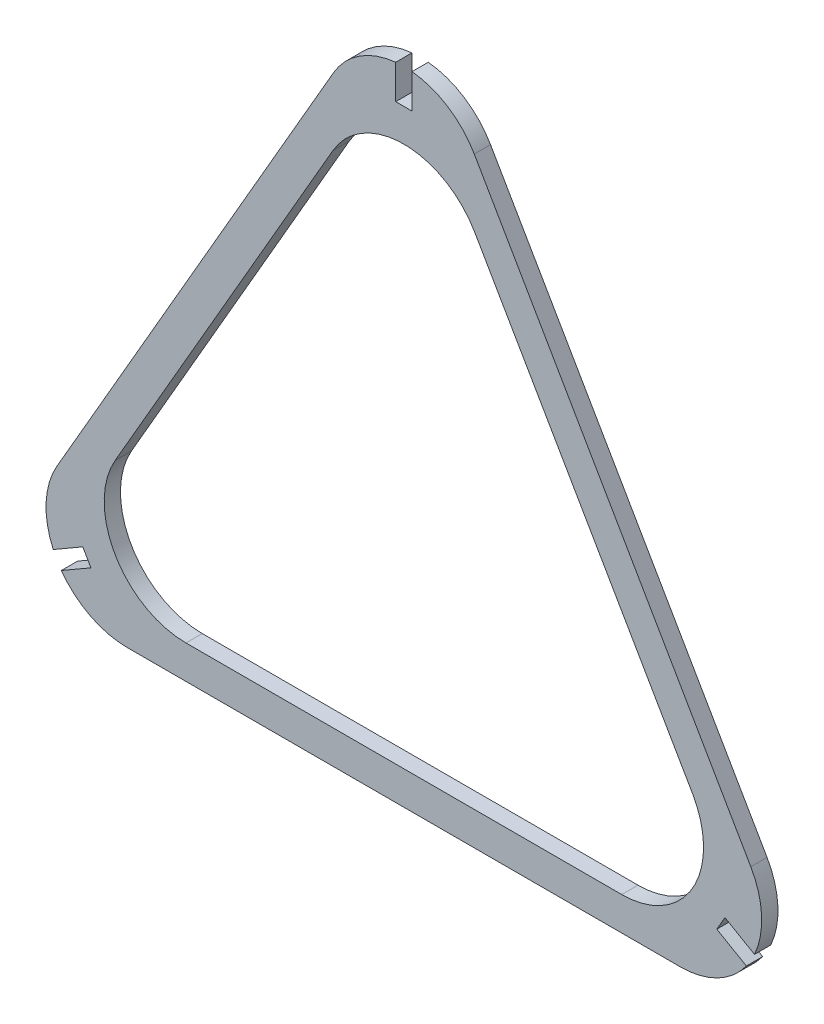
ISO-10303-21;
HEADER;
FILE_DESCRIPTION(('STEP AP214'),'2;1');
FILE_NAME('part.step','',(''),(''),'','','');
FILE_SCHEMA(('AUTOMOTIVE_DESIGN { 1 0 10303 214 1 1 1 1 }'));
ENDSEC;
DATA;
#1=APPLICATION_CONTEXT('core data for automotive mechanical design processes');
#2=APPLICATION_PROTOCOL_DEFINITION('international standard','automotive_design',2000,#1);
#3=PRODUCT_CONTEXT('',#1,'mechanical');
#4=PRODUCT('Part','Part','',(#3));
#5=PRODUCT_RELATED_PRODUCT_CATEGORY('part','',(#4));
#6=PRODUCT_DEFINITION_FORMATION('','',#4);
#7=PRODUCT_DEFINITION_CONTEXT('part definition',#1,'design');
#8=PRODUCT_DEFINITION('design','',#6,#7);
#9=PRODUCT_DEFINITION_SHAPE('','',#8);
#10=(LENGTH_UNIT() NAMED_UNIT(*) SI_UNIT(.MILLI.,.METRE.));
#11=(NAMED_UNIT(*) PLANE_ANGLE_UNIT() SI_UNIT($,.RADIAN.));
#12=(NAMED_UNIT(*) SI_UNIT($,.STERADIAN.) SOLID_ANGLE_UNIT());
#13=UNCERTAINTY_MEASURE_WITH_UNIT(LENGTH_MEASURE(1.E-05),#10,'distance_accuracy_value','');
#14=(GEOMETRIC_REPRESENTATION_CONTEXT(3) GLOBAL_UNCERTAINTY_ASSIGNED_CONTEXT((#13)) GLOBAL_UNIT_ASSIGNED_CONTEXT((#10,
#11,#12)) REPRESENTATION_CONTEXT('',''));
#15=CARTESIAN_POINT('',(0.,0.,0.));
#16=DIRECTION('',(0.,0.,1.));
#17=DIRECTION('',(1.,0.,0.));
#18=AXIS2_PLACEMENT_3D('',#15,#16,#17);
#19=CARTESIAN_POINT('',(0.,0.,4.));
#20=DIRECTION('',(0.,0.,1.));
#21=DIRECTION('',(1.,0.,0.));
#22=AXIS2_PLACEMENT_3D('',#19,#20,#21);
#23=PLANE('',#22);
#24=DIRECTION('',(-0.5,0.866025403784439,0.));
#25=VECTOR('',#24,1.);
#26=CARTESIAN_POINT('',(71.0334802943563,-20.8861989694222,4.));
#27=LINE('',#26,#25);
#28=CARTESIAN_POINT('',(71.0334802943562,-20.8861989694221,4.));
#29=VERTEX_POINT('',#28);
#30=CARTESIAN_POINT('',(17.4287612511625,71.9598979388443,4.));
#31=VERTEX_POINT('',#30);
#32=EDGE_CURVE('E343',#29,#31,#27,.T.);
#33=ORIENTED_EDGE('',*,*,#32,.F.);
#34=CARTESIAN_POINT('',(53.6047190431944,-30.9486989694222,4.));
#35=DIRECTION('',(0.,0.,1.));
#36=DIRECTION('',(1.,0.,0.));
#37=AXIS2_PLACEMENT_3D('',#34,#35,#36);
#38=CIRCLE('',#37,20.125);
#39=CARTESIAN_POINT('',(53.6047190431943,-51.0736989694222,4.));
#40=VERTEX_POINT('',#39);
#41=EDGE_CURVE('E312',#29,#40,#38,.F.);
#42=ORIENTED_EDGE('',*,*,#41,.T.);
#43=DIRECTION('',(1.,0.,0.));
#44=VECTOR('',#43,1.);
#45=CARTESIAN_POINT('',(53.6047190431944,-51.0736989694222,4.));
#46=LINE('',#45,#44);
#47=CARTESIAN_POINT('',(-53.6047190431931,-51.0736989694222,4.));
#48=VERTEX_POINT('',#47);
#49=EDGE_CURVE('E331',#48,#40,#46,.T.);
#50=ORIENTED_EDGE('',*,*,#49,.F.);
#51=CARTESIAN_POINT('',(-53.6047190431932,-30.9486989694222,4.));
#52=DIRECTION('',(0.,0.,1.));
#53=DIRECTION('',(1.,0.,0.));
#54=AXIS2_PLACEMENT_3D('',#51,#52,#53);
#55=CIRCLE('',#54,20.125);
#56=CARTESIAN_POINT('',(-71.033480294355,-20.8861989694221,4.));
#57=VERTEX_POINT('',#56);
#58=EDGE_CURVE('E334',#57,#48,#55,.T.);
#59=ORIENTED_EDGE('',*,*,#58,.F.);
#60=DIRECTION('',(-0.5,-0.866025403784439,0.));
#61=VECTOR('',#60,1.);
#62=CARTESIAN_POINT('',(-44.2311207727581,25.5368494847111,4.));
#63=LINE('',#62,#61);
#64=CARTESIAN_POINT('',(-17.4287612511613,71.9598979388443,4.));
#65=VERTEX_POINT('',#64);
#66=EDGE_CURVE('E337',#65,#57,#63,.T.);
#67=ORIENTED_EDGE('',*,*,#66,.F.);
#68=CARTESIAN_POINT('',(6.24500451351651E-13,61.8973979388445,4.));
#69=DIRECTION('',(0.,0.,1.));
#70=DIRECTION('',(1.,0.,0.));
#71=AXIS2_PLACEMENT_3D('',#68,#69,#70);
#72=CIRCLE('',#71,20.125);
#73=EDGE_CURVE('E340',#31,#65,#72,.T.);
#74=ORIENTED_EDGE('',*,*,#73,.F.);
#75=EDGE_LOOP('',(#33,#42,#50,#59,#67,#74));
#76=FACE_BOUND('',#75,.T.);
#77=CARTESIAN_POINT('',(68.0384757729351,-39.2820323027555,4.));
#78=DIRECTION('',(0.,0.,1.));
#79=DIRECTION('',(1.,0.,0.));
#80=AXIS2_PLACEMENT_3D('',#77,#78,#79);
#81=CIRCLE('',#80,20.);
#82=CARTESIAN_POINT('',(68.0384757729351,-59.2820323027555,4.));
#83=VERTEX_POINT('',#82);
#84=CARTESIAN_POINT('',(84.2721637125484,-50.9639574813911,4.));
#85=VERTEX_POINT('',#84);
#86=EDGE_CURVE('E218',#83,#85,#81,.T.);
#87=ORIENTED_EDGE('',*,*,#86,.T.);
#88=DIRECTION('',(-0.866025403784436,0.500000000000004,0.));
#89=VECTOR('',#88,1.);
#90=CARTESIAN_POINT('',(77.1039637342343,-46.8253952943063,4.));
#91=LINE('',#90,#89);
#92=CARTESIAN_POINT('',(76.9957105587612,-46.7628952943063,4.));
#93=VERTEX_POINT('',#92);
#94=EDGE_CURVE('E448',#85,#93,#91,.T.);
#95=ORIENTED_EDGE('',*,*,#94,.T.);
#96=DIRECTION('',(-0.500000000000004,-0.866025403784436,0.));
#97=VECTOR('',#96,1.);
#98=CARTESIAN_POINT('',(78.9332105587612,-43.4070468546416,4.));
#99=LINE('',#98,#97);
#100=CARTESIAN_POINT('',(78.9957105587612,-43.2987936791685,4.));
#101=VERTEX_POINT('',#100);
#102=EDGE_CURVE('E211',#93,#101,#99,.F.);
#103=ORIENTED_EDGE('',*,*,#102,.T.);
#104=DIRECTION('',(0.866025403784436,-0.500000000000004,0.));
#105=VECTOR('',#104,1.);
#106=CARTESIAN_POINT('',(79.1039637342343,-43.3612936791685,4.));
#107=LINE('',#106,#105);
#108=CARTESIAN_POINT('',(86.2721637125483,-47.4998558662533,4.));
#109=VERTEX_POINT('',#108);
#110=EDGE_CURVE('E198',#101,#109,#107,.T.);
#111=ORIENTED_EDGE('',*,*,#110,.T.);
#112=CARTESIAN_POINT('',(85.3589838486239,-29.2820323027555,4.));
#113=VERTEX_POINT('',#112);
#114=EDGE_CURVE('E208',#109,#113,#81,.T.);
#115=ORIENTED_EDGE('',*,*,#114,.T.);
#116=DIRECTION('',(-0.5,0.866025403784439,0.));
#117=VECTOR('',#116,1.);
#118=CARTESIAN_POINT('',(102.679491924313,-59.2820323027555,4.));
#119=LINE('',#118,#117);
#120=CARTESIAN_POINT('',(17.3205080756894,88.5640646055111,4.));
#121=VERTEX_POINT('',#120);
#122=EDGE_CURVE('E221',#113,#121,#119,.T.);
#123=ORIENTED_EDGE('',*,*,#122,.T.);
#124=CARTESIAN_POINT('',(6.27969898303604E-13,78.5640646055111,4.));
#125=DIRECTION('',(0.,0.,1.));
#126=DIRECTION('',(1.,0.,0.));
#127=AXIS2_PLACEMENT_3D('',#124,#125,#126);
#128=CIRCLE('',#127,20.);
#129=CARTESIAN_POINT('',(2.,98.4638133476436,4.));
#130=VERTEX_POINT('',#129);
#131=EDGE_CURVE('E40',#121,#130,#128,.T.);
#132=ORIENTED_EDGE('',*,*,#131,.T.);
#133=DIRECTION('',(0.,-1.,0.));
#134=VECTOR('',#133,1.);
#135=CARTESIAN_POINT('',(2.,90.1866889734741,4.));
#136=LINE('',#135,#134);
#137=CARTESIAN_POINT('',(2.,90.0616889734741,4.));
#138=VERTEX_POINT('',#137);
#139=EDGE_CURVE('E246',#130,#138,#136,.T.);
#140=ORIENTED_EDGE('',*,*,#139,.T.);
#141=DIRECTION('',(1.,0.,0.));
#142=VECTOR('',#141,1.);
#143=CARTESIAN_POINT('',(-1.875,90.0616889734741,4.));
#144=LINE('',#143,#142);
#145=CARTESIAN_POINT('',(-2.,90.0616889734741,4.));
#146=VERTEX_POINT('',#145);
#147=EDGE_CURVE('E249',#138,#146,#144,.F.);
#148=ORIENTED_EDGE('',*,*,#147,.T.);
#149=DIRECTION('',(0.,1.,0.));
#150=VECTOR('',#149,1.);
#151=CARTESIAN_POINT('',(-2.,90.1866889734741,4.));
#152=LINE('',#151,#150);
#153=CARTESIAN_POINT('',(-2.,98.4638133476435,4.));
#154=VERTEX_POINT('',#153);
#155=EDGE_CURVE('E252',#146,#154,#152,.T.);
#156=ORIENTED_EDGE('',*,*,#155,.T.);
#157=CARTESIAN_POINT('',(-17.3205080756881,88.5640646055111,4.));
#158=VERTEX_POINT('',#157);
#159=EDGE_CURVE('E254',#154,#158,#128,.T.);
#160=ORIENTED_EDGE('',*,*,#159,.T.);
#161=DIRECTION('',(-0.5,-0.866025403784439,0.));
#162=VECTOR('',#161,1.);
#163=CARTESIAN_POINT('',(6.24500451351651E-13,118.564064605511,4.));
#164=LINE('',#163,#162);
#165=CARTESIAN_POINT('',(-85.3589838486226,-29.2820323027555,4.));
#166=VERTEX_POINT('',#165);
#167=EDGE_CURVE('E292',#158,#166,#164,.T.);
#168=ORIENTED_EDGE('',*,*,#167,.T.);
#169=CARTESIAN_POINT('',(-68.0384757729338,-39.2820323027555,4.));
#170=DIRECTION('',(0.,0.,1.));
#171=DIRECTION('',(1.,0.,0.));
#172=AXIS2_PLACEMENT_3D('',#169,#170,#171);
#173=CIRCLE('',#172,20.);
#174=CARTESIAN_POINT('',(-86.2721637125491,-47.4998558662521,4.));
#175=VERTEX_POINT('',#174);
#176=EDGE_CURVE('E223',#166,#175,#173,.T.);
#177=ORIENTED_EDGE('',*,*,#176,.T.);
#178=DIRECTION('',(0.866025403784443,0.499999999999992,0.));
#179=VECTOR('',#178,1.);
#180=CARTESIAN_POINT('',(-79.1039637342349,-43.3612936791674,4.));
#181=LINE('',#180,#179);
#182=CARTESIAN_POINT('',(-78.9957105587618,-43.2987936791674,4.));
#183=VERTEX_POINT('',#182);
#184=EDGE_CURVE('E479',#175,#183,#181,.T.);
#185=ORIENTED_EDGE('',*,*,#184,.T.);
#186=DIRECTION('',(-0.499999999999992,0.866025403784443,0.));
#187=VECTOR('',#186,1.);
#188=CARTESIAN_POINT('',(-77.0582105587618,-46.6546421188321,4.));
#189=LINE('',#188,#187);
#190=CARTESIAN_POINT('',(-76.9957105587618,-46.7628952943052,4.));
#191=VERTEX_POINT('',#190);
#192=EDGE_CURVE('E470',#183,#191,#189,.F.);
#193=ORIENTED_EDGE('',*,*,#192,.T.);
#194=DIRECTION('',(-0.866025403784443,-0.499999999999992,0.));
#195=VECTOR('',#194,1.);
#196=CARTESIAN_POINT('',(-77.1039637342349,-46.8253952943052,4.));
#197=LINE('',#196,#195);
#198=CARTESIAN_POINT('',(-84.272163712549,-50.9639574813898,4.));
#199=VERTEX_POINT('',#198);
#200=EDGE_CURVE('E461',#191,#199,#197,.T.);
#201=ORIENTED_EDGE('',*,*,#200,.T.);
#202=CARTESIAN_POINT('',(-68.0384757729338,-59.2820323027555,4.));
#203=VERTEX_POINT('',#202);
#204=EDGE_CURVE('E231',#199,#203,#173,.T.);
#205=ORIENTED_EDGE('',*,*,#204,.T.);
#206=DIRECTION('',(1.,0.,0.));
#207=VECTOR('',#206,1.);
#208=CARTESIAN_POINT('',(-102.679491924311,-59.2820323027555,4.));
#209=LINE('',#208,#207);
#210=EDGE_CURVE('E219',#203,#83,#209,.T.);
#211=ORIENTED_EDGE('',*,*,#210,.T.);
#212=EDGE_LOOP('',(#87,#95,#103,#111,#115,#123,#132,#140,#148,#156,#160,#168,#177,#185,#193,
#201,#205,#211));
#213=FACE_BOUND('',#212,.T.);
#214=ADVANCED_FACE('F37',(#76,#213),#23,.T.);
#215=CARTESIAN_POINT('',(0.,0.,0.));
#216=DIRECTION('',(0.,0.,1.));
#217=DIRECTION('',(1.,0.,0.));
#218=AXIS2_PLACEMENT_3D('',#215,#216,#217);
#219=PLANE('',#218);
#220=CARTESIAN_POINT('',(53.6047190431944,-30.9486989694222,0.));
#221=DIRECTION('',(0.,0.,-1.));
#222=DIRECTION('',(-1.,0.,0.));
#223=AXIS2_PLACEMENT_3D('',#220,#221,#222);
#224=CIRCLE('',#223,20.125);
#225=CARTESIAN_POINT('',(71.0334802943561,-20.886198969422,0.));
#226=VERTEX_POINT('',#225);
#227=CARTESIAN_POINT('',(53.6047190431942,-51.0736989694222,0.));
#228=VERTEX_POINT('',#227);
#229=EDGE_CURVE('E234',#226,#228,#224,.T.);
#230=ORIENTED_EDGE('',*,*,#229,.F.);
#231=DIRECTION('',(-0.5,0.866025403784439,0.));
#232=VECTOR('',#231,1.);
#233=CARTESIAN_POINT('',(71.0334802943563,-20.8861989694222,0.));
#234=LINE('',#233,#232);
#235=CARTESIAN_POINT('',(17.4287612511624,71.9598979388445,0.));
#236=VERTEX_POINT('',#235);
#237=EDGE_CURVE('E291',#226,#236,#234,.T.);
#238=ORIENTED_EDGE('',*,*,#237,.T.);
#239=CARTESIAN_POINT('',(6.24500451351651E-13,61.8973979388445,0.));
#240=DIRECTION('',(0.,0.,-1.));
#241=DIRECTION('',(-1.,0.,0.));
#242=AXIS2_PLACEMENT_3D('',#239,#240,#241);
#243=CIRCLE('',#242,20.125);
#244=CARTESIAN_POINT('',(-17.4287612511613,71.9598979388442,0.));
#245=VERTEX_POINT('',#244);
#246=EDGE_CURVE('E359',#236,#245,#243,.F.);
#247=ORIENTED_EDGE('',*,*,#246,.T.);
#248=DIRECTION('',(-0.5,-0.866025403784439,0.));
#249=VECTOR('',#248,1.);
#250=CARTESIAN_POINT('',(-44.2311207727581,25.5368494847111,0.));
#251=LINE('',#250,#249);
#252=CARTESIAN_POINT('',(-71.0334802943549,-20.886198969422,0.));
#253=VERTEX_POINT('',#252);
#254=EDGE_CURVE('E284',#245,#253,#251,.T.);
#255=ORIENTED_EDGE('',*,*,#254,.T.);
#256=CARTESIAN_POINT('',(-53.6047190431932,-30.9486989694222,0.));
#257=DIRECTION('',(0.,0.,-1.));
#258=DIRECTION('',(-1.,0.,0.));
#259=AXIS2_PLACEMENT_3D('',#256,#257,#258);
#260=CIRCLE('',#259,20.125);
#261=CARTESIAN_POINT('',(-53.6047190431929,-51.0736989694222,0.));
#262=VERTEX_POINT('',#261);
#263=EDGE_CURVE('E278',#253,#262,#260,.F.);
#264=ORIENTED_EDGE('',*,*,#263,.T.);
#265=DIRECTION('',(1.,0.,0.));
#266=VECTOR('',#265,1.);
#267=CARTESIAN_POINT('',(53.6047190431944,-51.0736989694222,0.));
#268=LINE('',#267,#266);
#269=EDGE_CURVE('E270',#262,#228,#268,.T.);
#270=ORIENTED_EDGE('',*,*,#269,.T.);
#271=EDGE_LOOP('',(#230,#238,#247,#255,#264,#270));
#272=FACE_BOUND('',#271,.T.);
#273=DIRECTION('',(-0.866025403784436,0.500000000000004,0.));
#274=VECTOR('',#273,1.);
#275=CARTESIAN_POINT('',(-1.00000000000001,-1.73205080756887,0.));
#276=LINE('',#275,#274);
#277=CARTESIAN_POINT('',(84.2721637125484,-50.9639574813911,0.));
#278=VERTEX_POINT('',#277);
#279=CARTESIAN_POINT('',(76.9957105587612,-46.7628952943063,0.));
#280=VERTEX_POINT('',#279);
#281=EDGE_CURVE('E451',#278,#280,#276,.T.);
#282=ORIENTED_EDGE('',*,*,#281,.F.);
#283=CARTESIAN_POINT('',(68.0384757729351,-39.2820323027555,0.));
#284=DIRECTION('',(0.,0.,1.));
#285=DIRECTION('',(1.,0.,0.));
#286=AXIS2_PLACEMENT_3D('',#283,#284,#285);
#287=CIRCLE('',#286,20.);
#288=CARTESIAN_POINT('',(68.0384757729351,-59.2820323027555,0.));
#289=VERTEX_POINT('',#288);
#290=EDGE_CURVE('E269',#278,#289,#287,.F.);
#291=ORIENTED_EDGE('',*,*,#290,.T.);
#292=DIRECTION('',(1.,0.,0.));
#293=VECTOR('',#292,1.);
#294=CARTESIAN_POINT('',(-102.679491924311,-59.2820323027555,0.));
#295=LINE('',#294,#293);
#296=CARTESIAN_POINT('',(-68.0384757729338,-59.2820323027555,0.));
#297=VERTEX_POINT('',#296);
#298=EDGE_CURVE('E235',#297,#289,#295,.T.);
#299=ORIENTED_EDGE('',*,*,#298,.F.);
#300=CARTESIAN_POINT('',(-68.0384757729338,-39.2820323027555,0.));
#301=DIRECTION('',(0.,0.,1.));
#302=DIRECTION('',(1.,0.,0.));
#303=AXIS2_PLACEMENT_3D('',#300,#301,#302);
#304=CIRCLE('',#303,20.);
#305=CARTESIAN_POINT('',(-84.2721637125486,-50.9639574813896,0.));
#306=VERTEX_POINT('',#305);
#307=EDGE_CURVE('E258',#297,#306,#304,.F.);
#308=ORIENTED_EDGE('',*,*,#307,.T.);
#309=DIRECTION('',(-0.866025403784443,-0.499999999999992,0.));
#310=VECTOR('',#309,1.);
#311=CARTESIAN_POINT('',(0.999999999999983,-1.73205080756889,0.));
#312=LINE('',#311,#310);
#313=CARTESIAN_POINT('',(-76.9957105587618,-46.7628952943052,0.));
#314=VERTEX_POINT('',#313);
#315=EDGE_CURVE('E53',#314,#306,#312,.T.);
#316=ORIENTED_EDGE('',*,*,#315,.F.);
#317=DIRECTION('',(0.499999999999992,-0.866025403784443,0.));
#318=VECTOR('',#317,1.);
#319=CARTESIAN_POINT('',(-77.9957105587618,-45.0308444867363,0.));
#320=LINE('',#319,#318);
#321=CARTESIAN_POINT('',(-78.9957105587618,-43.2987936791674,0.));
#322=VERTEX_POINT('',#321);
#323=EDGE_CURVE('E467',#322,#314,#320,.T.);
#324=ORIENTED_EDGE('',*,*,#323,.F.);
#325=DIRECTION('',(0.866025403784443,0.499999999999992,0.));
#326=VECTOR('',#325,1.);
#327=CARTESIAN_POINT('',(-0.999999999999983,1.73205080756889,0.));
#328=LINE('',#327,#326);
#329=CARTESIAN_POINT('',(-86.2721637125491,-47.4998558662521,0.));
#330=VERTEX_POINT('',#329);
#331=EDGE_CURVE('E476',#330,#322,#328,.T.);
#332=ORIENTED_EDGE('',*,*,#331,.F.);
#333=CARTESIAN_POINT('',(-85.3589838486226,-29.2820323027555,0.));
#334=VERTEX_POINT('',#333);
#335=EDGE_CURVE('E267',#330,#334,#304,.F.);
#336=ORIENTED_EDGE('',*,*,#335,.T.);
#337=DIRECTION('',(-0.5,-0.866025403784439,0.));
#338=VECTOR('',#337,1.);
#339=CARTESIAN_POINT('',(6.24500451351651E-13,118.564064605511,0.));
#340=LINE('',#339,#338);
#341=CARTESIAN_POINT('',(-17.3205080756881,88.5640646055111,0.));
#342=VERTEX_POINT('',#341);
#343=EDGE_CURVE('E297',#342,#334,#340,.T.);
#344=ORIENTED_EDGE('',*,*,#343,.F.);
#345=CARTESIAN_POINT('',(6.27969898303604E-13,78.5640646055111,0.));
#346=DIRECTION('',(0.,0.,1.));
#347=DIRECTION('',(1.,0.,0.));
#348=AXIS2_PLACEMENT_3D('',#345,#346,#347);
#349=CIRCLE('',#348,20.);
#350=CARTESIAN_POINT('',(-2.,98.4638133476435,0.));
#351=VERTEX_POINT('',#350);
#352=EDGE_CURVE('E255',#342,#351,#349,.F.);
#353=ORIENTED_EDGE('',*,*,#352,.T.);
#354=DIRECTION('',(0.,1.,0.));
#355=VECTOR('',#354,1.);
#356=CARTESIAN_POINT('',(-2.,0.,0.));
#357=LINE('',#356,#355);
#358=CARTESIAN_POINT('',(-2.,90.0616889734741,0.));
#359=VERTEX_POINT('',#358);
#360=EDGE_CURVE('E11',#359,#351,#357,.T.);
#361=ORIENTED_EDGE('',*,*,#360,.F.);
#362=DIRECTION('',(-1.,0.,0.));
#363=VECTOR('',#362,1.);
#364=CARTESIAN_POINT('',(0.,90.0616889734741,0.));
#365=LINE('',#364,#363);
#366=CARTESIAN_POINT('',(2.,90.0616889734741,0.));
#367=VERTEX_POINT('',#366);
#368=EDGE_CURVE('E244',#367,#359,#365,.T.);
#369=ORIENTED_EDGE('',*,*,#368,.F.);
#370=DIRECTION('',(0.,-1.,0.));
#371=VECTOR('',#370,1.);
#372=CARTESIAN_POINT('',(2.,0.,0.));
#373=LINE('',#372,#371);
#374=CARTESIAN_POINT('',(2.,98.4638133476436,0.));
#375=VERTEX_POINT('',#374);
#376=EDGE_CURVE('E240',#375,#367,#373,.T.);
#377=ORIENTED_EDGE('',*,*,#376,.F.);
#378=CARTESIAN_POINT('',(17.3205080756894,88.5640646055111,0.));
#379=VERTEX_POINT('',#378);
#380=EDGE_CURVE('E259',#375,#379,#349,.F.);
#381=ORIENTED_EDGE('',*,*,#380,.T.);
#382=DIRECTION('',(-0.5,0.866025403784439,0.));
#383=VECTOR('',#382,1.);
#384=CARTESIAN_POINT('',(102.679491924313,-59.2820323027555,0.));
#385=LINE('',#384,#383);
#386=CARTESIAN_POINT('',(85.3589838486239,-29.2820323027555,0.));
#387=VERTEX_POINT('',#386);
#388=EDGE_CURVE('E295',#387,#379,#385,.T.);
#389=ORIENTED_EDGE('',*,*,#388,.F.);
#390=CARTESIAN_POINT('',(86.2721637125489,-47.4998558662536,0.));
#391=VERTEX_POINT('',#390);
#392=EDGE_CURVE('E275',#387,#391,#287,.F.);
#393=ORIENTED_EDGE('',*,*,#392,.T.);
#394=DIRECTION('',(0.866025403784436,-0.500000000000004,0.));
#395=VECTOR('',#394,1.);
#396=CARTESIAN_POINT('',(1.00000000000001,1.73205080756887,0.));
#397=LINE('',#396,#395);
#398=CARTESIAN_POINT('',(78.9957105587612,-43.2987936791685,0.));
#399=VERTEX_POINT('',#398);
#400=EDGE_CURVE('E61',#399,#391,#397,.T.);
#401=ORIENTED_EDGE('',*,*,#400,.F.);
#402=DIRECTION('',(0.500000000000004,0.866025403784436,0.));
#403=VECTOR('',#402,1.);
#404=CARTESIAN_POINT('',(77.9957105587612,-45.0308444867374,0.));
#405=LINE('',#404,#403);
#406=EDGE_CURVE('E492',#280,#399,#405,.T.);
#407=ORIENTED_EDGE('',*,*,#406,.F.);
#408=EDGE_LOOP('',(#282,#291,#299,#308,#316,#324,#332,#336,#344,#353,#361,#369,#377,#381,#389,
#393,#401,#407));
#409=FACE_BOUND('',#408,.T.);
#410=ADVANCED_FACE('F363',(#272,#409),#219,.F.);
#411=CARTESIAN_POINT('',(-68.0384757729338,-39.2820323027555,4.));
#412=DIRECTION('',(0.,0.,-1.));
#413=DIRECTION('',(-1.,0.,0.));
#414=AXIS2_PLACEMENT_3D('',#411,#412,#413);
#415=CYLINDRICAL_SURFACE('',#414,20.);
#416=ORIENTED_EDGE('',*,*,#335,.F.);
#417=DIRECTION('',(0.,0.,-1.));
#418=VECTOR('',#417,1.);
#419=CARTESIAN_POINT('',(-86.2721637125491,-47.4998558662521,4.));
#420=LINE('',#419,#418);
#421=EDGE_CURVE('E482',#330,#175,#420,.F.);
#422=ORIENTED_EDGE('',*,*,#421,.T.);
#423=ORIENTED_EDGE('',*,*,#176,.F.);
#424=DIRECTION('',(0.,0.,-1.));
#425=VECTOR('',#424,1.);
#426=CARTESIAN_POINT('',(-85.3589838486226,-29.2820323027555,4.));
#427=LINE('',#426,#425);
#428=EDGE_CURVE('E239',#334,#166,#427,.F.);
#429=ORIENTED_EDGE('',*,*,#428,.F.);
#430=EDGE_LOOP('',(#416,#422,#423,#429));
#431=FACE_BOUND('',#430,.T.);
#432=ADVANCED_FACE('F400',(#431),#415,.T.);
#433=ORIENTED_EDGE('',*,*,#204,.F.);
#434=DIRECTION('',(0.,0.,-1.));
#435=VECTOR('',#434,1.);
#436=CARTESIAN_POINT('',(-84.272163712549,-50.9639574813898,4.));
#437=LINE('',#436,#435);
#438=EDGE_CURVE('E443',#199,#306,#437,.T.);
#439=ORIENTED_EDGE('',*,*,#438,.T.);
#440=ORIENTED_EDGE('',*,*,#307,.F.);
#441=DIRECTION('',(0.,0.,-1.));
#442=VECTOR('',#441,1.);
#443=CARTESIAN_POINT('',(-68.0384757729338,-59.2820323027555,4.));
#444=LINE('',#443,#442);
#445=EDGE_CURVE('E236',#203,#297,#444,.T.);
#446=ORIENTED_EDGE('',*,*,#445,.F.);
#447=EDGE_LOOP('',(#433,#439,#440,#446));
#448=FACE_BOUND('',#447,.T.);
#449=ADVANCED_FACE('F404',(#448),#415,.T.);
#450=CARTESIAN_POINT('',(68.0384757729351,-39.2820323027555,4.));
#451=DIRECTION('',(0.,0.,-1.));
#452=DIRECTION('',(-1.,0.,0.));
#453=AXIS2_PLACEMENT_3D('',#450,#451,#452);
#454=CYLINDRICAL_SURFACE('',#453,20.);
#455=ORIENTED_EDGE('',*,*,#290,.F.);
#456=DIRECTION('',(0.,0.,-1.));
#457=VECTOR('',#456,1.);
#458=CARTESIAN_POINT('',(84.2721637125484,-50.9639574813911,4.));
#459=LINE('',#458,#457);
#460=EDGE_CURVE('E314',#278,#85,#459,.F.);
#461=ORIENTED_EDGE('',*,*,#460,.T.);
#462=ORIENTED_EDGE('',*,*,#86,.F.);
#463=DIRECTION('',(0.,0.,-1.));
#464=VECTOR('',#463,1.);
#465=CARTESIAN_POINT('',(68.0384757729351,-59.2820323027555,4.));
#466=LINE('',#465,#464);
#467=EDGE_CURVE('E232',#289,#83,#466,.F.);
#468=ORIENTED_EDGE('',*,*,#467,.F.);
#469=EDGE_LOOP('',(#455,#461,#462,#468));
#470=FACE_BOUND('',#469,.T.);
#471=ADVANCED_FACE('F421',(#470),#454,.T.);
#472=ORIENTED_EDGE('',*,*,#114,.F.);
#473=DIRECTION('',(0.,0.,-1.));
#474=VECTOR('',#473,1.);
#475=CARTESIAN_POINT('',(86.2721637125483,-47.4998558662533,4.));
#476=LINE('',#475,#474);
#477=EDGE_CURVE('E195',#109,#391,#476,.T.);
#478=ORIENTED_EDGE('',*,*,#477,.T.);
#479=ORIENTED_EDGE('',*,*,#392,.F.);
#480=DIRECTION('',(0.,0.,-1.));
#481=VECTOR('',#480,1.);
#482=CARTESIAN_POINT('',(85.3589838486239,-29.2820323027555,4.));
#483=LINE('',#482,#481);
#484=EDGE_CURVE('E217',#113,#387,#483,.T.);
#485=ORIENTED_EDGE('',*,*,#484,.F.);
#486=EDGE_LOOP('',(#472,#478,#479,#485));
#487=FACE_BOUND('',#486,.T.);
#488=ADVANCED_FACE('F215',(#487),#454,.T.);
#489=CARTESIAN_POINT('',(6.27969898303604E-13,78.5640646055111,4.));
#490=DIRECTION('',(0.,0.,-1.));
#491=DIRECTION('',(-1.,0.,0.));
#492=AXIS2_PLACEMENT_3D('',#489,#490,#491);
#493=CYLINDRICAL_SURFACE('',#492,20.);
#494=ORIENTED_EDGE('',*,*,#380,.F.);
#495=DIRECTION('',(0.,0.,-1.));
#496=VECTOR('',#495,1.);
#497=CARTESIAN_POINT('',(2.,98.4638133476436,4.));
#498=LINE('',#497,#496);
#499=EDGE_CURVE('E257',#375,#130,#498,.F.);
#500=ORIENTED_EDGE('',*,*,#499,.T.);
#501=ORIENTED_EDGE('',*,*,#131,.F.);
#502=DIRECTION('',(0.,0.,-1.));
#503=VECTOR('',#502,1.);
#504=CARTESIAN_POINT('',(17.3205080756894,88.5640646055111,4.));
#505=LINE('',#504,#503);
#506=EDGE_CURVE('E227',#379,#121,#505,.F.);
#507=ORIENTED_EDGE('',*,*,#506,.F.);
#508=EDGE_LOOP('',(#494,#500,#501,#507));
#509=FACE_BOUND('',#508,.T.);
#510=ADVANCED_FACE('F311',(#509),#493,.T.);
#511=ORIENTED_EDGE('',*,*,#159,.F.);
#512=DIRECTION('',(0.,0.,-1.));
#513=VECTOR('',#512,1.);
#514=CARTESIAN_POINT('',(-2.,98.4638133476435,4.));
#515=LINE('',#514,#513);
#516=EDGE_CURVE('E264',#154,#351,#515,.T.);
#517=ORIENTED_EDGE('',*,*,#516,.T.);
#518=ORIENTED_EDGE('',*,*,#352,.F.);
#519=DIRECTION('',(0.,0.,-1.));
#520=VECTOR('',#519,1.);
#521=CARTESIAN_POINT('',(-17.3205080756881,88.5640646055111,4.));
#522=LINE('',#521,#520);
#523=EDGE_CURVE('E300',#158,#342,#522,.T.);
#524=ORIENTED_EDGE('',*,*,#523,.F.);
#525=EDGE_LOOP('',(#511,#517,#518,#524));
#526=FACE_BOUND('',#525,.T.);
#527=ADVANCED_FACE('F326',(#526),#493,.T.);
#528=CARTESIAN_POINT('',(102.679491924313,-59.2820323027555,4.));
#529=DIRECTION('',(-0.866025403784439,-0.5,0.));
#530=DIRECTION('',(0.5,-0.866025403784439,0.));
#531=AXIS2_PLACEMENT_3D('',#528,#529,#530);
#532=PLANE('',#531);
#533=ORIENTED_EDGE('',*,*,#388,.T.);
#534=ORIENTED_EDGE('',*,*,#506,.T.);
#535=ORIENTED_EDGE('',*,*,#122,.F.);
#536=ORIENTED_EDGE('',*,*,#484,.T.);
#537=EDGE_LOOP('',(#533,#534,#535,#536));
#538=FACE_BOUND('',#537,.T.);
#539=ADVANCED_FACE('F307',(#538),#532,.F.);
#540=CARTESIAN_POINT('',(6.24500451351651E-13,118.564064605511,4.));
#541=DIRECTION('',(0.866025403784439,-0.5,0.));
#542=DIRECTION('',(0.5,0.866025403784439,0.));
#543=AXIS2_PLACEMENT_3D('',#540,#541,#542);
#544=PLANE('',#543);
#545=ORIENTED_EDGE('',*,*,#167,.F.);
#546=ORIENTED_EDGE('',*,*,#523,.T.);
#547=ORIENTED_EDGE('',*,*,#343,.T.);
#548=ORIENTED_EDGE('',*,*,#428,.T.);
#549=EDGE_LOOP('',(#545,#546,#547,#548));
#550=FACE_BOUND('',#549,.T.);
#551=ADVANCED_FACE('F324',(#550),#544,.F.);
#552=CARTESIAN_POINT('',(-102.679491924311,-59.2820323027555,4.));
#553=DIRECTION('',(0.,1.,0.));
#554=DIRECTION('',(0.,0.,1.));
#555=AXIS2_PLACEMENT_3D('',#552,#553,#554);
#556=PLANE('',#555);
#557=ORIENTED_EDGE('',*,*,#210,.F.);
#558=ORIENTED_EDGE('',*,*,#445,.T.);
#559=ORIENTED_EDGE('',*,*,#298,.T.);
#560=ORIENTED_EDGE('',*,*,#467,.T.);
#561=EDGE_LOOP('',(#557,#558,#559,#560));
#562=FACE_BOUND('',#561,.T.);
#563=ADVANCED_FACE('F429',(#562),#556,.F.);
#564=CARTESIAN_POINT('',(53.6047190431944,-30.9486989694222,0.));
#565=DIRECTION('',(0.,0.,1.));
#566=DIRECTION('',(1.,0.,0.));
#567=AXIS2_PLACEMENT_3D('',#564,#565,#566);
#568=CYLINDRICAL_SURFACE('',#567,20.125);
#569=DIRECTION('',(0.,0.,1.));
#570=VECTOR('',#569,1.);
#571=CARTESIAN_POINT('',(71.0334802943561,-20.886198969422,0.));
#572=LINE('',#571,#570);
#573=EDGE_CURVE('E345',#226,#29,#572,.T.);
#574=ORIENTED_EDGE('',*,*,#573,.F.);
#575=ORIENTED_EDGE('',*,*,#229,.T.);
#576=DIRECTION('',(0.,0.,1.));
#577=VECTOR('',#576,1.);
#578=CARTESIAN_POINT('',(53.6047190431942,-51.0736989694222,0.));
#579=LINE('',#578,#577);
#580=EDGE_CURVE('E289',#228,#40,#579,.T.);
#581=ORIENTED_EDGE('',*,*,#580,.T.);
#582=ORIENTED_EDGE('',*,*,#41,.F.);
#583=EDGE_LOOP('',(#574,#575,#581,#582));
#584=FACE_BOUND('',#583,.T.);
#585=ADVANCED_FACE('F377',(#584),#568,.F.);
#586=CARTESIAN_POINT('',(53.6047190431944,-51.0736989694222,0.));
#587=DIRECTION('',(0.,-1.,0.));
#588=DIRECTION('',(0.,0.,-1.));
#589=AXIS2_PLACEMENT_3D('',#586,#587,#588);
#590=PLANE('',#589);
#591=ORIENTED_EDGE('',*,*,#49,.T.);
#592=ORIENTED_EDGE('',*,*,#580,.F.);
#593=ORIENTED_EDGE('',*,*,#269,.F.);
#594=DIRECTION('',(0.,0.,1.));
#595=VECTOR('',#594,1.);
#596=CARTESIAN_POINT('',(-53.6047190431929,-51.0736989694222,0.));
#597=LINE('',#596,#595);
#598=EDGE_CURVE('E333',#262,#48,#597,.T.);
#599=ORIENTED_EDGE('',*,*,#598,.T.);
#600=EDGE_LOOP('',(#591,#592,#593,#599));
#601=FACE_BOUND('',#600,.T.);
#602=ADVANCED_FACE('F374',(#601),#590,.F.);
#603=CARTESIAN_POINT('',(-53.6047190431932,-30.9486989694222,0.));
#604=DIRECTION('',(0.,0.,1.));
#605=DIRECTION('',(1.,0.,0.));
#606=AXIS2_PLACEMENT_3D('',#603,#604,#605);
#607=CYLINDRICAL_SURFACE('',#606,20.125);
#608=ORIENTED_EDGE('',*,*,#58,.T.);
#609=ORIENTED_EDGE('',*,*,#598,.F.);
#610=ORIENTED_EDGE('',*,*,#263,.F.);
#611=DIRECTION('',(0.,0.,1.));
#612=VECTOR('',#611,1.);
#613=CARTESIAN_POINT('',(-71.0334802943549,-20.886198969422,0.));
#614=LINE('',#613,#612);
#615=EDGE_CURVE('E336',#253,#57,#614,.T.);
#616=ORIENTED_EDGE('',*,*,#615,.T.);
#617=EDGE_LOOP('',(#608,#609,#610,#616));
#618=FACE_BOUND('',#617,.T.);
#619=ADVANCED_FACE('F370',(#618),#607,.F.);
#620=CARTESIAN_POINT('',(-44.2311207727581,25.5368494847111,0.));
#621=DIRECTION('',(-0.866025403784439,0.5,0.));
#622=DIRECTION('',(-0.5,-0.866025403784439,0.));
#623=AXIS2_PLACEMENT_3D('',#620,#621,#622);
#624=PLANE('',#623);
#625=ORIENTED_EDGE('',*,*,#66,.T.);
#626=ORIENTED_EDGE('',*,*,#615,.F.);
#627=ORIENTED_EDGE('',*,*,#254,.F.);
#628=DIRECTION('',(0.,0.,1.));
#629=VECTOR('',#628,1.);
#630=CARTESIAN_POINT('',(-17.4287612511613,71.9598979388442,0.));
#631=LINE('',#630,#629);
#632=EDGE_CURVE('E339',#245,#65,#631,.T.);
#633=ORIENTED_EDGE('',*,*,#632,.T.);
#634=EDGE_LOOP('',(#625,#626,#627,#633));
#635=FACE_BOUND('',#634,.T.);
#636=ADVANCED_FACE('F366',(#635),#624,.F.);
#637=CARTESIAN_POINT('',(6.24500451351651E-13,61.8973979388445,0.));
#638=DIRECTION('',(0.,0.,1.));
#639=DIRECTION('',(1.,0.,0.));
#640=AXIS2_PLACEMENT_3D('',#637,#638,#639);
#641=CYLINDRICAL_SURFACE('',#640,20.125);
#642=ORIENTED_EDGE('',*,*,#73,.T.);
#643=ORIENTED_EDGE('',*,*,#632,.F.);
#644=ORIENTED_EDGE('',*,*,#246,.F.);
#645=DIRECTION('',(0.,0.,1.));
#646=VECTOR('',#645,1.);
#647=CARTESIAN_POINT('',(17.4287612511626,71.9598979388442,0.));
#648=LINE('',#647,#646);
#649=EDGE_CURVE('E342',#236,#31,#648,.T.);
#650=ORIENTED_EDGE('',*,*,#649,.T.);
#651=EDGE_LOOP('',(#642,#643,#644,#650));
#652=FACE_BOUND('',#651,.T.);
#653=ADVANCED_FACE('F386',(#652),#641,.F.);
#654=CARTESIAN_POINT('',(71.0334802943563,-20.8861989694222,0.));
#655=DIRECTION('',(0.866025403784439,0.5,0.));
#656=DIRECTION('',(-0.5,0.866025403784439,0.));
#657=AXIS2_PLACEMENT_3D('',#654,#655,#656);
#658=PLANE('',#657);
#659=ORIENTED_EDGE('',*,*,#32,.T.);
#660=ORIENTED_EDGE('',*,*,#649,.F.);
#661=ORIENTED_EDGE('',*,*,#237,.F.);
#662=ORIENTED_EDGE('',*,*,#573,.T.);
#663=EDGE_LOOP('',(#659,#660,#661,#662));
#664=FACE_BOUND('',#663,.T.);
#665=ADVANCED_FACE('F383',(#664),#658,.F.);
#666=CARTESIAN_POINT('',(-1.875,90.0616889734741,-6.));
#667=DIRECTION('',(0.,1.,0.));
#668=DIRECTION('',(0.,0.,1.));
#669=AXIS2_PLACEMENT_3D('',#666,#667,#668);
#670=PLANE('',#669);
#671=ORIENTED_EDGE('',*,*,#368,.T.);
#672=DIRECTION('',(0.,0.,1.));
#673=VECTOR('',#672,1.);
#674=CARTESIAN_POINT('',(-2.,90.0616889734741,-6.));
#675=LINE('',#674,#673);
#676=EDGE_CURVE('E241',#359,#146,#675,.T.);
#677=ORIENTED_EDGE('',*,*,#676,.T.);
#678=ORIENTED_EDGE('',*,*,#147,.F.);
#679=DIRECTION('',(0.,0.,1.));
#680=VECTOR('',#679,1.);
#681=CARTESIAN_POINT('',(2.,90.0616889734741,-6.));
#682=LINE('',#681,#680);
#683=EDGE_CURVE('E45',#367,#138,#682,.T.);
#684=ORIENTED_EDGE('',*,*,#683,.F.);
#685=EDGE_LOOP('',(#671,#677,#678,#684));
#686=FACE_BOUND('',#685,.T.);
#687=ADVANCED_FACE('F393',(#686),#670,.T.);
#688=CARTESIAN_POINT('',(2.,90.1866889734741,-6.));
#689=DIRECTION('',(-1.,0.,0.));
#690=DIRECTION('',(0.,-1.,0.));
#691=AXIS2_PLACEMENT_3D('',#688,#689,#690);
#692=PLANE('',#691);
#693=ORIENTED_EDGE('',*,*,#376,.T.);
#694=ORIENTED_EDGE('',*,*,#683,.T.);
#695=ORIENTED_EDGE('',*,*,#139,.F.);
#696=ORIENTED_EDGE('',*,*,#499,.F.);
#697=EDGE_LOOP('',(#693,#694,#695,#696));
#698=FACE_BOUND('',#697,.T.);
#699=ADVANCED_FACE('F410',(#698),#692,.T.);
#700=CARTESIAN_POINT('',(-2.,90.1866889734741,-6.));
#701=DIRECTION('',(1.,0.,0.));
#702=DIRECTION('',(0.,1.,0.));
#703=AXIS2_PLACEMENT_3D('',#700,#701,#702);
#704=PLANE('',#703);
#705=ORIENTED_EDGE('',*,*,#360,.T.);
#706=ORIENTED_EDGE('',*,*,#516,.F.);
#707=ORIENTED_EDGE('',*,*,#155,.F.);
#708=ORIENTED_EDGE('',*,*,#676,.F.);
#709=EDGE_LOOP('',(#705,#706,#707,#708));
#710=FACE_BOUND('',#709,.T.);
#711=ADVANCED_FACE('F413',(#710),#704,.T.);
#712=CARTESIAN_POINT('',(77.1039637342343,-46.8253952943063,-6.));
#713=DIRECTION('',(0.500000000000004,0.866025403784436,0.));
#714=DIRECTION('',(-0.866025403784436,0.500000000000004,0.));
#715=AXIS2_PLACEMENT_3D('',#712,#713,#714);
#716=PLANE('',#715);
#717=ORIENTED_EDGE('',*,*,#281,.T.);
#718=DIRECTION('',(0.,0.,1.));
#719=VECTOR('',#718,1.);
#720=CARTESIAN_POINT('',(76.9957105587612,-46.7628952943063,-6.));
#721=LINE('',#720,#719);
#722=EDGE_CURVE('E455',#280,#93,#721,.T.);
#723=ORIENTED_EDGE('',*,*,#722,.T.);
#724=ORIENTED_EDGE('',*,*,#94,.F.);
#725=ORIENTED_EDGE('',*,*,#460,.F.);
#726=EDGE_LOOP('',(#717,#723,#724,#725));
#727=FACE_BOUND('',#726,.T.);
#728=ADVANCED_FACE('F420',(#727),#716,.T.);
#729=CARTESIAN_POINT('',(78.9332105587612,-43.4070468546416,-6.));
#730=DIRECTION('',(0.866025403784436,-0.500000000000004,0.));
#731=DIRECTION('',(0.,0.,1.));
#732=AXIS2_PLACEMENT_3D('',#729,#730,#731);
#733=PLANE('',#732);
#734=ORIENTED_EDGE('',*,*,#406,.T.);
#735=DIRECTION('',(0.,0.,1.));
#736=VECTOR('',#735,1.);
#737=CARTESIAN_POINT('',(78.9957105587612,-43.2987936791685,-6.));
#738=LINE('',#737,#736);
#739=EDGE_CURVE('E212',#399,#101,#738,.T.);
#740=ORIENTED_EDGE('',*,*,#739,.T.);
#741=ORIENTED_EDGE('',*,*,#102,.F.);
#742=ORIENTED_EDGE('',*,*,#722,.F.);
#743=EDGE_LOOP('',(#734,#740,#741,#742));
#744=FACE_BOUND('',#743,.T.);
#745=ADVANCED_FACE('F497',(#744),#733,.T.);
#746=CARTESIAN_POINT('',(79.1039637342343,-43.3612936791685,-6.));
#747=DIRECTION('',(-0.500000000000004,-0.866025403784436,0.));
#748=DIRECTION('',(0.866025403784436,-0.500000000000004,0.));
#749=AXIS2_PLACEMENT_3D('',#746,#747,#748);
#750=PLANE('',#749);
#751=ORIENTED_EDGE('',*,*,#400,.T.);
#752=ORIENTED_EDGE('',*,*,#477,.F.);
#753=ORIENTED_EDGE('',*,*,#110,.F.);
#754=ORIENTED_EDGE('',*,*,#739,.F.);
#755=EDGE_LOOP('',(#751,#752,#753,#754));
#756=FACE_BOUND('',#755,.T.);
#757=ADVANCED_FACE('F197',(#756),#750,.T.);
#758=CARTESIAN_POINT('',(-79.1039637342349,-43.3612936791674,-6.));
#759=DIRECTION('',(0.499999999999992,-0.866025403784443,0.));
#760=DIRECTION('',(0.866025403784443,0.499999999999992,0.));
#761=AXIS2_PLACEMENT_3D('',#758,#759,#760);
#762=PLANE('',#761);
#763=ORIENTED_EDGE('',*,*,#331,.T.);
#764=DIRECTION('',(0.,0.,1.));
#765=VECTOR('',#764,1.);
#766=CARTESIAN_POINT('',(-78.9957105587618,-43.2987936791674,-6.));
#767=LINE('',#766,#765);
#768=EDGE_CURVE('E473',#322,#183,#767,.T.);
#769=ORIENTED_EDGE('',*,*,#768,.T.);
#770=ORIENTED_EDGE('',*,*,#184,.F.);
#771=ORIENTED_EDGE('',*,*,#421,.F.);
#772=EDGE_LOOP('',(#763,#769,#770,#771));
#773=FACE_BOUND('',#772,.T.);
#774=ADVANCED_FACE('F504',(#773),#762,.T.);
#775=CARTESIAN_POINT('',(-77.0582105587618,-46.6546421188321,-6.));
#776=DIRECTION('',(-0.866025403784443,-0.499999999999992,0.));
#777=DIRECTION('',(0.,0.,1.));
#778=AXIS2_PLACEMENT_3D('',#775,#776,#777);
#779=PLANE('',#778);
#780=ORIENTED_EDGE('',*,*,#323,.T.);
#781=DIRECTION('',(0.,0.,1.));
#782=VECTOR('',#781,1.);
#783=CARTESIAN_POINT('',(-76.9957105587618,-46.7628952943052,-6.));
#784=LINE('',#783,#782);
#785=EDGE_CURVE('E464',#314,#191,#784,.T.);
#786=ORIENTED_EDGE('',*,*,#785,.T.);
#787=ORIENTED_EDGE('',*,*,#192,.F.);
#788=ORIENTED_EDGE('',*,*,#768,.F.);
#789=EDGE_LOOP('',(#780,#786,#787,#788));
#790=FACE_BOUND('',#789,.T.);
#791=ADVANCED_FACE('F511',(#790),#779,.T.);
#792=CARTESIAN_POINT('',(-77.1039637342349,-46.8253952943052,-6.));
#793=DIRECTION('',(-0.499999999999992,0.866025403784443,0.));
#794=DIRECTION('',(-0.866025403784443,-0.499999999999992,0.));
#795=AXIS2_PLACEMENT_3D('',#792,#793,#794);
#796=PLANE('',#795);
#797=ORIENTED_EDGE('',*,*,#315,.T.);
#798=ORIENTED_EDGE('',*,*,#438,.F.);
#799=ORIENTED_EDGE('',*,*,#200,.F.);
#800=ORIENTED_EDGE('',*,*,#785,.F.);
#801=EDGE_LOOP('',(#797,#798,#799,#800));
#802=FACE_BOUND('',#801,.T.);
#803=ADVANCED_FACE('F508',(#802),#796,.T.);
#804=CLOSED_SHELL('',(#214,#410,#432,#449,#471,#488,#510,#527,#539,#551,#563,#585,#602,#619,
#636,#653,#665,#687,#699,#711,#728,#745,#757,#774,#791,#803));
#805=MANIFOLD_SOLID_BREP('B2',#804);
#806=ADVANCED_BREP_SHAPE_REPRESENTATION('',(#18,#805),#14);
#807=SHAPE_DEFINITION_REPRESENTATION(#9,#806);
ENDSEC;
END-ISO-10303-21;
